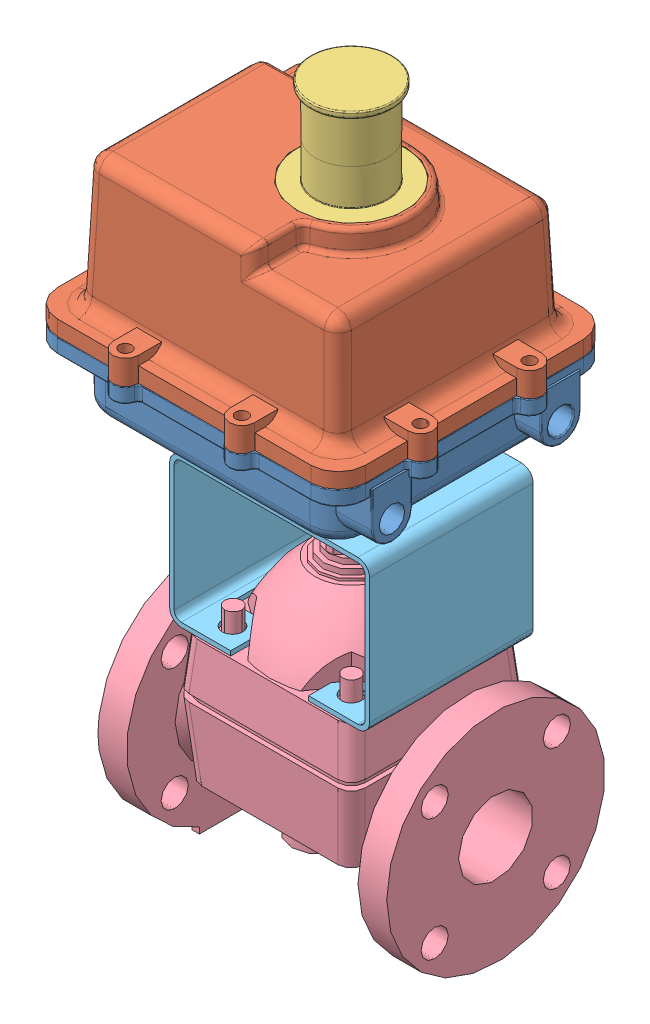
SolidWorks assembly T14DVFL_2IN_SERIES92.SLDASM, configuration Default (file format 3800). Lengths in mm.
Overall size (271.07 484.63 246.15).
6 component instances, 5 part files, 9 mates.
Components (placement in the parent):
- SERIES_92_ACT-1: SERIES_92_ACT.SLDASM [Default] at (-21.5808 245.0084 0) size (271.07 230.12 246.15)
  - SERIES_92 BASE-1: SERIES_92 BASE.SLDPRT [Default] x (0 0 1) z (1 0 0) size (246.15 66.7 271.07)
  - SERIES_92 COVER-1: SERIES_92 COVER.SLDPRT [Default] at origin size (233.43 103.04 208.74)
  - SERIES_92 KNOB-1: SERIES_92 KNOB.SLDPRT [Default] at (21.5808 163.4236 0) x (1 0 0) z (0 0 -1) size (75.69 63.14 75.69)
- 14DV_20_F-1: 14DV_20_F.SLDPRT [Default] x (0 0 1) z (-1 0 0) size (152.4 309.5 201.68)
- 14DV_20_F_BRKT-1: 14DV_20_F_BRKT.SLDPRT [Default] at (0 74.168 -57.15) size (139.7 104.14 114.3)
Mates (geometry in assembly coordinates):
- Coincident1: coincident aligned: plane of ? through (5.8034 245.0084 0) normal (0 0 1)
- Distance1: distance = 245.0084 mm aligned: unknown of SERIES_92_ACT-1/SERIES_92 COVER-1
- Concentric4: concentric aligned: cone of ?; cylinder of ?
- Coincident9: coincident aligned: unknown of ?
- Coincident10: coincident aligned: unknown of ?
- Coincident11: coincident anti-aligned: plane of ? through (52.1698 178.308 24.7855) normal (0 -1 0); plane of ? through (-34.2907 178.308 57.15) normal (0 1 0)
- Concentric5: concentric aligned: cylinder of ?; circle of ?
- Parallel1: parallel aligned: plane of ? through (0 128.2223 0) normal (0 1 0); plane of ? through (97.2343 82.343 57.15) normal (1 0 0)
- Coincident13: coincident anti-aligned: plane of ?; plane of assembly
